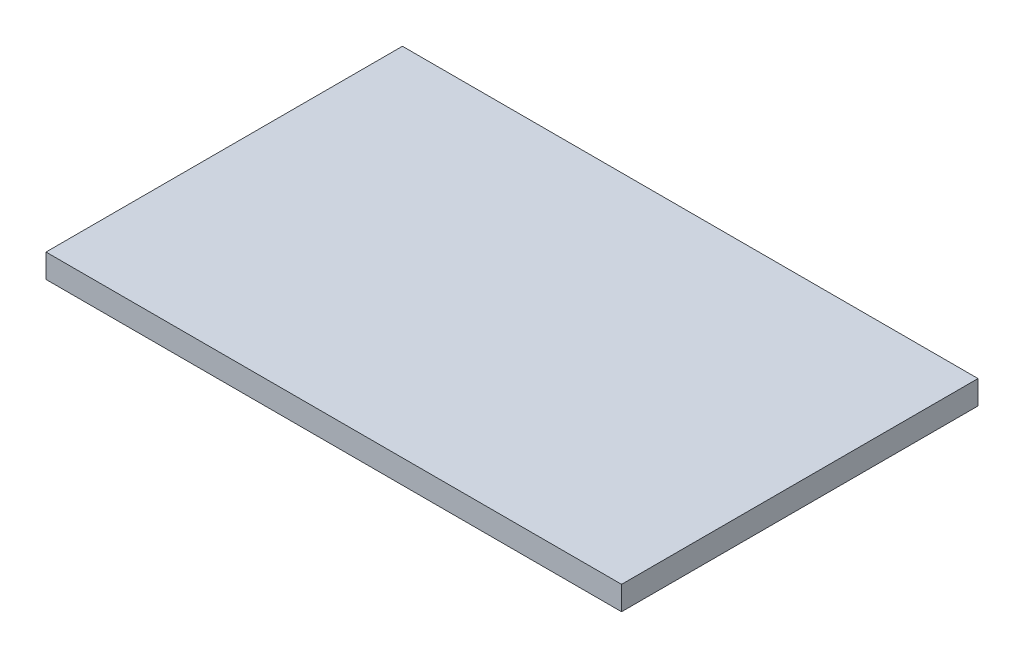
ISO-10303-21;
HEADER;
FILE_DESCRIPTION(('STEP AP214'),'2;1');
FILE_NAME('part.step','',(''),(''),'','','');
FILE_SCHEMA(('AUTOMOTIVE_DESIGN { 1 0 10303 214 1 1 1 1 }'));
ENDSEC;
DATA;
#1=APPLICATION_CONTEXT('core data for automotive mechanical design processes');
#2=APPLICATION_PROTOCOL_DEFINITION('international standard','automotive_design',2000,#1);
#3=PRODUCT_CONTEXT('',#1,'mechanical');
#4=PRODUCT('Part','Part','',(#3));
#5=PRODUCT_RELATED_PRODUCT_CATEGORY('part','',(#4));
#6=PRODUCT_DEFINITION_FORMATION('','',#4);
#7=PRODUCT_DEFINITION_CONTEXT('part definition',#1,'design');
#8=PRODUCT_DEFINITION('design','',#6,#7);
#9=PRODUCT_DEFINITION_SHAPE('','',#8);
#10=(LENGTH_UNIT() NAMED_UNIT(*) SI_UNIT(.MILLI.,.METRE.));
#11=(NAMED_UNIT(*) PLANE_ANGLE_UNIT() SI_UNIT($,.RADIAN.));
#12=(NAMED_UNIT(*) SI_UNIT($,.STERADIAN.) SOLID_ANGLE_UNIT());
#13=UNCERTAINTY_MEASURE_WITH_UNIT(LENGTH_MEASURE(1.E-05),#10,'distance_accuracy_value','');
#14=(GEOMETRIC_REPRESENTATION_CONTEXT(3) GLOBAL_UNCERTAINTY_ASSIGNED_CONTEXT((#13)) GLOBAL_UNIT_ASSIGNED_CONTEXT((#10,
#11,#12)) REPRESENTATION_CONTEXT('',''));
#15=CARTESIAN_POINT('',(0.,0.,0.));
#16=DIRECTION('',(0.,0.,1.));
#17=DIRECTION('',(1.,0.,0.));
#18=AXIS2_PLACEMENT_3D('',#15,#16,#17);
#19=CARTESIAN_POINT('',(0.,5.,0.));
#20=DIRECTION('',(1.,0.,0.));
#21=DIRECTION('',(0.,0.,-1.));
#22=AXIS2_PLACEMENT_3D('',#19,#20,#21);
#23=PLANE('',#22);
#24=DIRECTION('',(0.,0.,1.));
#25=VECTOR('',#24,1.);
#26=CARTESIAN_POINT('',(0.,0.,0.));
#27=LINE('',#26,#25);
#28=CARTESIAN_POINT('',(0.,0.,-74.9909948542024));
#29=VERTEX_POINT('',#28);
#30=CARTESIAN_POINT('',(0.,0.,0.));
#31=VERTEX_POINT('',#30);
#32=EDGE_CURVE('E409',#29,#31,#27,.T.);
#33=ORIENTED_EDGE('',*,*,#32,.T.);
#34=DIRECTION('',(0.,-1.,0.));
#35=VECTOR('',#34,1.);
#36=CARTESIAN_POINT('',(0.,5.,0.));
#37=LINE('',#36,#35);
#38=CARTESIAN_POINT('',(0.,5.,0.));
#39=VERTEX_POINT('',#38);
#40=EDGE_CURVE('E12',#39,#31,#37,.T.);
#41=ORIENTED_EDGE('',*,*,#40,.F.);
#42=DIRECTION('',(0.,0.,1.));
#43=VECTOR('',#42,1.);
#44=CARTESIAN_POINT('',(0.,5.,0.));
#45=LINE('',#44,#43);
#46=CARTESIAN_POINT('',(0.,5.,-74.9909948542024));
#47=VERTEX_POINT('',#46);
#48=EDGE_CURVE('E427',#47,#39,#45,.T.);
#49=ORIENTED_EDGE('',*,*,#48,.F.);
#50=DIRECTION('',(0.,-1.,0.));
#51=VECTOR('',#50,1.);
#52=CARTESIAN_POINT('',(0.,5.,-74.9909948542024));
#53=LINE('',#52,#51);
#54=EDGE_CURVE('E421',#47,#29,#53,.T.);
#55=ORIENTED_EDGE('',*,*,#54,.T.);
#56=EDGE_LOOP('',(#33,#41,#49,#55));
#57=FACE_BOUND('',#56,.T.);
#58=ADVANCED_FACE('F365',(#57),#23,.F.);
#59=CARTESIAN_POINT('',(0.,5.,0.));
#60=DIRECTION('',(0.,0.,-1.));
#61=DIRECTION('',(-1.,0.,0.));
#62=AXIS2_PLACEMENT_3D('',#59,#60,#61);
#63=PLANE('',#62);
#64=DIRECTION('',(1.,0.,0.));
#65=VECTOR('',#64,1.);
#66=CARTESIAN_POINT('',(0.,0.,0.));
#67=LINE('',#66,#65);
#68=CARTESIAN_POINT('',(121.096569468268,0.,0.));
#69=VERTEX_POINT('',#68);
#70=EDGE_CURVE('E405',#31,#69,#67,.T.);
#71=ORIENTED_EDGE('',*,*,#70,.T.);
#72=DIRECTION('',(0.,-1.,0.));
#73=VECTOR('',#72,1.);
#74=CARTESIAN_POINT('',(121.096569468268,5.,0.));
#75=LINE('',#74,#73);
#76=CARTESIAN_POINT('',(121.096569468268,5.,0.));
#77=VERTEX_POINT('',#76);
#78=EDGE_CURVE('E372',#77,#69,#75,.T.);
#79=ORIENTED_EDGE('',*,*,#78,.F.);
#80=DIRECTION('',(1.,0.,0.));
#81=VECTOR('',#80,1.);
#82=CARTESIAN_POINT('',(0.,5.,0.));
#83=LINE('',#82,#81);
#84=EDGE_CURVE('E417',#39,#77,#83,.T.);
#85=ORIENTED_EDGE('',*,*,#84,.F.);
#86=ORIENTED_EDGE('',*,*,#40,.T.);
#87=EDGE_LOOP('',(#71,#79,#85,#86));
#88=FACE_BOUND('',#87,.T.);
#89=ADVANCED_FACE('F416',(#88),#63,.F.);
#90=CARTESIAN_POINT('',(121.096569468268,5.,0.));
#91=DIRECTION('',(-1.,0.,0.));
#92=DIRECTION('',(0.,0.,1.));
#93=AXIS2_PLACEMENT_3D('',#90,#91,#92);
#94=PLANE('',#93);
#95=DIRECTION('',(0.,0.,-1.));
#96=VECTOR('',#95,1.);
#97=CARTESIAN_POINT('',(121.096569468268,0.,0.));
#98=LINE('',#97,#96);
#99=CARTESIAN_POINT('',(121.096569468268,0.,-74.9909948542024));
#100=VERTEX_POINT('',#99);
#101=EDGE_CURVE('E410',#69,#100,#98,.T.);
#102=ORIENTED_EDGE('',*,*,#101,.T.);
#103=DIRECTION('',(0.,-1.,0.));
#104=VECTOR('',#103,1.);
#105=CARTESIAN_POINT('',(121.096569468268,5.,-74.9909948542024));
#106=LINE('',#105,#104);
#107=CARTESIAN_POINT('',(121.096569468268,5.,-74.9909948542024));
#108=VERTEX_POINT('',#107);
#109=EDGE_CURVE('E433',#108,#100,#106,.T.);
#110=ORIENTED_EDGE('',*,*,#109,.F.);
#111=DIRECTION('',(0.,0.,-1.));
#112=VECTOR('',#111,1.);
#113=CARTESIAN_POINT('',(121.096569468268,5.,0.));
#114=LINE('',#113,#112);
#115=EDGE_CURVE('E384',#77,#108,#114,.T.);
#116=ORIENTED_EDGE('',*,*,#115,.F.);
#117=ORIENTED_EDGE('',*,*,#78,.T.);
#118=EDGE_LOOP('',(#102,#110,#116,#117));
#119=FACE_BOUND('',#118,.T.);
#120=ADVANCED_FACE('F436',(#119),#94,.F.);
#121=CARTESIAN_POINT('',(0.,5.,-74.9909948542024));
#122=DIRECTION('',(0.,0.,1.));
#123=DIRECTION('',(1.,0.,0.));
#124=AXIS2_PLACEMENT_3D('',#121,#122,#123);
#125=PLANE('',#124);
#126=DIRECTION('',(-1.,0.,0.));
#127=VECTOR('',#126,1.);
#128=CARTESIAN_POINT('',(0.,0.,-74.9909948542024));
#129=LINE('',#128,#127);
#130=EDGE_CURVE('E425',#100,#29,#129,.T.);
#131=ORIENTED_EDGE('',*,*,#130,.T.);
#132=ORIENTED_EDGE('',*,*,#54,.F.);
#133=DIRECTION('',(-1.,0.,0.));
#134=VECTOR('',#133,1.);
#135=CARTESIAN_POINT('',(0.,5.,-74.9909948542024));
#136=LINE('',#135,#134);
#137=EDGE_CURVE('E379',#108,#47,#136,.T.);
#138=ORIENTED_EDGE('',*,*,#137,.F.);
#139=ORIENTED_EDGE('',*,*,#109,.T.);
#140=EDGE_LOOP('',(#131,#132,#138,#139));
#141=FACE_BOUND('',#140,.T.);
#142=ADVANCED_FACE('F438',(#141),#125,.F.);
#143=CARTESIAN_POINT('',(0.,5.,-74.9909948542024));
#144=DIRECTION('',(0.,-1.,0.));
#145=DIRECTION('',(0.,0.,-1.));
#146=AXIS2_PLACEMENT_3D('',#143,#144,#145);
#147=PLANE('',#146);
#148=ORIENTED_EDGE('',*,*,#48,.T.);
#149=ORIENTED_EDGE('',*,*,#84,.T.);
#150=ORIENTED_EDGE('',*,*,#115,.T.);
#151=ORIENTED_EDGE('',*,*,#137,.T.);
#152=EDGE_LOOP('',(#148,#149,#150,#151));
#153=FACE_BOUND('',#152,.T.);
#154=ADVANCED_FACE('F439',(#153),#147,.F.);
#155=CARTESIAN_POINT('',(0.,0.,-74.9909948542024));
#156=DIRECTION('',(0.,-1.,0.));
#157=DIRECTION('',(0.,0.,-1.));
#158=AXIS2_PLACEMENT_3D('',#155,#156,#157);
#159=PLANE('',#158);
#160=ORIENTED_EDGE('',*,*,#32,.F.);
#161=ORIENTED_EDGE('',*,*,#130,.F.);
#162=ORIENTED_EDGE('',*,*,#101,.F.);
#163=ORIENTED_EDGE('',*,*,#70,.F.);
#164=EDGE_LOOP('',(#160,#161,#162,#163));
#165=FACE_BOUND('',#164,.T.);
#166=ADVANCED_FACE('F406',(#165),#159,.T.);
#167=CLOSED_SHELL('',(#58,#89,#120,#142,#154,#166));
#168=MANIFOLD_SOLID_BREP('B2',#167);
#169=ADVANCED_BREP_SHAPE_REPRESENTATION('',(#18,#168),#14);
#170=SHAPE_DEFINITION_REPRESENTATION(#9,#169);
ENDSEC;
END-ISO-10303-21;
